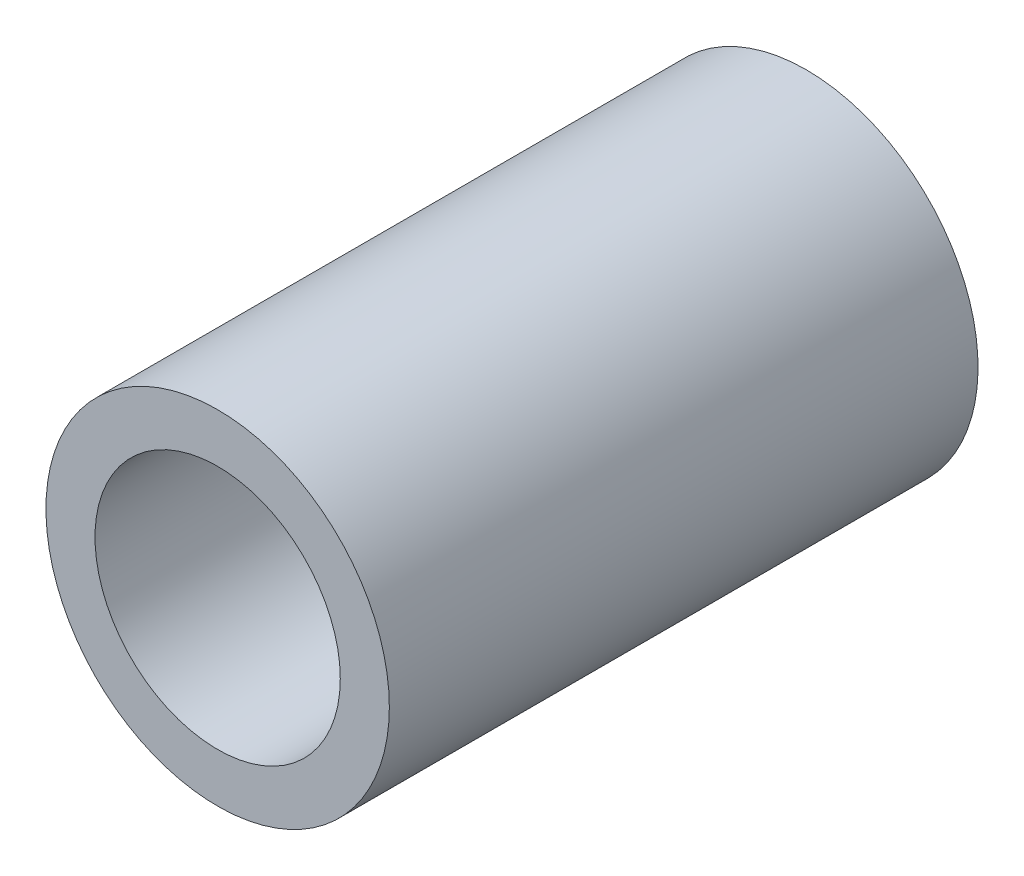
ISO-10303-21;
HEADER;
FILE_DESCRIPTION(('STEP AP214'),'2;1');
FILE_NAME('part.step','',(''),(''),'','','');
FILE_SCHEMA(('AUTOMOTIVE_DESIGN { 1 0 10303 214 1 1 1 1 }'));
ENDSEC;
DATA;
#1=APPLICATION_CONTEXT('core data for automotive mechanical design processes');
#2=APPLICATION_PROTOCOL_DEFINITION('international standard','automotive_design',2000,#1);
#3=PRODUCT_CONTEXT('',#1,'mechanical');
#4=PRODUCT('Part','Part','',(#3));
#5=PRODUCT_RELATED_PRODUCT_CATEGORY('part','',(#4));
#6=PRODUCT_DEFINITION_FORMATION('','',#4);
#7=PRODUCT_DEFINITION_CONTEXT('part definition',#1,'design');
#8=PRODUCT_DEFINITION('design','',#6,#7);
#9=PRODUCT_DEFINITION_SHAPE('','',#8);
#10=(LENGTH_UNIT() NAMED_UNIT(*) SI_UNIT(.MILLI.,.METRE.));
#11=(NAMED_UNIT(*) PLANE_ANGLE_UNIT() SI_UNIT($,.RADIAN.));
#12=(NAMED_UNIT(*) SI_UNIT($,.STERADIAN.) SOLID_ANGLE_UNIT());
#13=UNCERTAINTY_MEASURE_WITH_UNIT(LENGTH_MEASURE(1.E-05),#10,'distance_accuracy_value','');
#14=(GEOMETRIC_REPRESENTATION_CONTEXT(3) GLOBAL_UNCERTAINTY_ASSIGNED_CONTEXT((#13)) GLOBAL_UNIT_ASSIGNED_CONTEXT((#10,
#11,#12)) REPRESENTATION_CONTEXT('',''));
#15=CARTESIAN_POINT('',(0.,0.,0.));
#16=DIRECTION('',(0.,0.,1.));
#17=DIRECTION('',(1.,0.,0.));
#18=AXIS2_PLACEMENT_3D('',#15,#16,#17);
#19=CARTESIAN_POINT('',(0.,0.,65.));
#20=DIRECTION('',(0.,0.,-1.));
#21=DIRECTION('',(-1.,0.,0.));
#22=AXIS2_PLACEMENT_3D('',#19,#20,#21);
#23=CYLINDRICAL_SURFACE('',#22,17.5);
#24=CARTESIAN_POINT('',(0.,0.,65.));
#25=DIRECTION('',(0.,0.,1.));
#26=DIRECTION('',(1.,0.,0.));
#27=AXIS2_PLACEMENT_3D('',#24,#25,#26);
#28=CIRCLE('',#27,17.5);
#29=CARTESIAN_POINT('',(17.5,0.,65.));
#30=VERTEX_POINT('',#29);
#31=EDGE_CURVE('E118',#30,#30,#28,.T.);
#32=ORIENTED_EDGE('',*,*,#31,.F.);
#33=EDGE_LOOP('',(#32));
#34=FACE_BOUND('',#33,.T.);
#35=CARTESIAN_POINT('',(0.,0.,35.));
#36=DIRECTION('',(0.,0.,-1.));
#37=DIRECTION('',(-1.,0.,0.));
#38=AXIS2_PLACEMENT_3D('',#35,#36,#37);
#39=CIRCLE('',#38,17.5);
#40=CARTESIAN_POINT('',(-2.5,-17.3205080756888,35.));
#41=VERTEX_POINT('',#40);
#42=CARTESIAN_POINT('',(2.49999999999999,-17.3205080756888,35.));
#43=VERTEX_POINT('',#42);
#44=EDGE_CURVE('E106',#41,#43,#39,.F.);
#45=ORIENTED_EDGE('',*,*,#44,.T.);
#46=CARTESIAN_POINT('',(2.49999999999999,-17.3205080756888,35.));
#47=CARTESIAN_POINT('',(2.63552451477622,-17.3009488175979,35.00000101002));
#48=CARTESIAN_POINT('',(2.7707973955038,-17.2797975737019,34.9972444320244));
#49=CARTESIAN_POINT('',(3.0405860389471,-17.2343708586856,34.9862902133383));
#50=CARTESIAN_POINT('',(3.17510185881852,-17.2100956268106,34.9780929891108));
#51=CARTESIAN_POINT('',(3.57689084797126,-17.1327213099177,34.9454730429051));
#52=CARTESIAN_POINT('',(3.84268283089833,-17.0750334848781,34.9130217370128));
#53=CARTESIAN_POINT('',(4.36637452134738,-16.9486550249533,34.8278483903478));
#54=CARTESIAN_POINT('',(4.6243145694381,-16.880039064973,34.7752607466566));
#55=CARTESIAN_POINT('',(5.13252513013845,-16.7325192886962,34.6508164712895));
#56=CARTESIAN_POINT('',(5.38279434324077,-16.6536137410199,34.578956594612));
#57=CARTESIAN_POINT('',(5.87346725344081,-16.4869441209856,34.417337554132));
#58=CARTESIAN_POINT('',(6.11389903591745,-16.3992081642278,34.327634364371));
#59=CARTESIAN_POINT('',(6.58463102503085,-16.2159314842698,34.131310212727));
#60=CARTESIAN_POINT('',(6.81493157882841,-16.1203910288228,34.0246898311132));
#61=CARTESIAN_POINT('',(7.26496027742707,-15.9226526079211,33.7953989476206));
#62=CARTESIAN_POINT('',(7.48466983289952,-15.8204436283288,33.6727015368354));
#63=CARTESIAN_POINT('',(7.91247912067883,-15.6108752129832,33.4123590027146));
#64=CARTESIAN_POINT('',(8.12057754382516,-15.5035151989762,33.2747121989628));
#65=CARTESIAN_POINT('',(8.54774178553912,-15.2725764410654,32.9687828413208));
#66=CARTESIAN_POINT('',(8.76534456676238,-15.1485460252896,32.7987968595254));
#67=CARTESIAN_POINT('',(9.18494033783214,-14.8978725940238,32.4422700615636));
#68=CARTESIAN_POINT('',(9.38693168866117,-14.7712293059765,32.2557275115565));
#69=CARTESIAN_POINT('',(9.77484393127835,-14.5174435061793,31.866740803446));
#70=CARTESIAN_POINT('',(9.9607578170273,-14.3903008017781,31.6642897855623));
#71=CARTESIAN_POINT('',(10.31582005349,-14.1379376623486,31.244086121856));
#72=CARTESIAN_POINT('',(10.4849700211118,-14.0127170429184,31.0263349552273));
#73=CARTESIAN_POINT('',(10.7927724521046,-13.7768123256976,30.5941470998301));
#74=CARTESIAN_POINT('',(10.9327857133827,-13.6657728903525,30.3808736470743));
#75=CARTESIAN_POINT('',(11.1973235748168,-13.4498732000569,29.9418854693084));
#76=CARTESIAN_POINT('',(11.3218472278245,-13.3450133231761,29.7161699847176));
#77=CARTESIAN_POINT('',(11.5542769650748,-13.1442853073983,29.2528981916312));
#78=CARTESIAN_POINT('',(11.6622046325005,-13.0484055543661,29.0153578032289));
#79=CARTESIAN_POINT('',(11.8604501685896,-12.8684752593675,28.5285973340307));
#80=CARTESIAN_POINT('',(11.9507663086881,-12.7844258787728,28.2793761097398));
#81=CARTESIAN_POINT('',(12.0934930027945,-12.6492970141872,27.8296378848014));
#82=CARTESIAN_POINT('',(12.1498325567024,-12.5950982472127,27.6313000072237));
#83=CARTESIAN_POINT('',(12.2505720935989,-12.4971366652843,27.22918345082));
#84=CARTESIAN_POINT('',(12.2949793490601,-12.4533674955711,27.0254081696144));
#85=CARTESIAN_POINT('',(12.3711345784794,-12.3777183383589,26.613817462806));
#86=CARTESIAN_POINT('',(12.4029112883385,-12.3458113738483,26.4060123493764));
#87=CARTESIAN_POINT('',(12.4533700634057,-12.2949125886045,25.987330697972));
#88=CARTESIAN_POINT('',(12.4720603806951,-12.2759126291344,25.77645618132));
#89=CARTESIAN_POINT('',(12.4893506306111,-12.2583100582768,25.4709030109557));
#90=CARTESIAN_POINT('',(12.4933430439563,-12.2542400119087,25.3767952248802));
#91=CARTESIAN_POINT('',(12.4986674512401,-12.24880901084,25.1884625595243));
#92=CARTESIAN_POINT('',(12.5000004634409,-12.2474470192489,25.0942377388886));
#93=CARTESIAN_POINT('',(12.5,-12.2474487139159,25.));
#94=B_SPLINE_CURVE_WITH_KNOTS('',3,(#46,#47,#48,#49,#50,#51,#52,#53,#54,#55,#56,#57,#58,#59,#60,
#61,#62,#63,#64,#65,#66,#67,#68,#69,#70,#71,#72,#73,#74,#75,#76,#77,#78,#79,#80,#81,#82,#83,#84,
#85,#86,#87,#88,#89,#90,#91,#92,#93),.UNSPECIFIED.,.F.,.F.,(4,2,2,2,2,2,2,2,2,2,2,2,2,2,2,2,2,2,
2,2,2,2,2,4),(0.,0.410707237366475,0.821383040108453,1.64189733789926,2.45702808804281,
3.27229617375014,4.08504600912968,4.89776797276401,5.71186803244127,6.52605969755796,
7.43326698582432,8.34056939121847,9.24826519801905,10.1558733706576,10.9898789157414,
11.8239354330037,12.6568979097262,13.4899421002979,14.1289211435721,14.7675098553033,
15.4046372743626,16.0413625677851,16.3241393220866,16.6068077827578),.UNSPECIFIED.);
#95=CARTESIAN_POINT('',(12.5,-12.2474487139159,25.));
#96=VERTEX_POINT('',#95);
#97=EDGE_CURVE('E132',#43,#96,#94,.T.);
#98=ORIENTED_EDGE('',*,*,#97,.T.);
#99=DIRECTION('',(0.,0.,-1.));
#100=VECTOR('',#99,1.);
#101=CARTESIAN_POINT('',(12.5,-12.2474487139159,65.));
#102=LINE('',#101,#100);
#103=CARTESIAN_POINT('',(12.5,-12.2474487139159,5.));
#104=VERTEX_POINT('',#103);
#105=EDGE_CURVE('E115',#96,#104,#102,.T.);
#106=ORIENTED_EDGE('',*,*,#105,.T.);
#107=CARTESIAN_POINT('',(0.,0.,5.));
#108=DIRECTION('',(0.,0.,1.));
#109=DIRECTION('',(1.,0.,0.));
#110=AXIS2_PLACEMENT_3D('',#107,#108,#109);
#111=CIRCLE('',#110,17.5);
#112=CARTESIAN_POINT('',(-12.5,-12.2474487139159,5.));
#113=VERTEX_POINT('',#112);
#114=EDGE_CURVE('E100',#104,#113,#111,.T.);
#115=ORIENTED_EDGE('',*,*,#114,.T.);
#116=DIRECTION('',(0.,0.,-1.));
#117=VECTOR('',#116,1.);
#118=CARTESIAN_POINT('',(-12.5,-12.2474487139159,65.));
#119=LINE('',#118,#117);
#120=CARTESIAN_POINT('',(-12.5,-12.2474487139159,25.));
#121=VERTEX_POINT('',#120);
#122=EDGE_CURVE('E105',#113,#121,#119,.F.);
#123=ORIENTED_EDGE('',*,*,#122,.T.);
#124=CARTESIAN_POINT('',(-12.5,-12.2474487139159,25.));
#125=CARTESIAN_POINT('',(-12.5000022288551,-12.2474428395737,25.1186163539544));
#126=CARTESIAN_POINT('',(-12.497888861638,-12.2496037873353,25.2372115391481));
#127=CARTESIAN_POINT('',(-12.4894586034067,-12.2582004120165,25.4740839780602));
#128=CARTESIAN_POINT('',(-12.4831421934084,-12.2646355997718,25.5923612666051));
#129=CARTESIAN_POINT('',(-12.4579593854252,-12.2902342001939,25.945919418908));
#130=CARTESIAN_POINT('',(-12.432859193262,-12.3156910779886,26.1803549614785));
#131=CARTESIAN_POINT('',(-12.3670172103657,-12.3818013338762,26.6418606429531));
#132=CARTESIAN_POINT('',(-12.3264647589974,-12.4222706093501,26.8689851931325));
#133=CARTESIAN_POINT('',(-12.2305142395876,-12.5167506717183,27.3172508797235));
#134=CARTESIAN_POINT('',(-12.1751111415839,-12.5707660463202,27.5383899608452));
#135=CARTESIAN_POINT('',(-12.0507574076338,-12.6900196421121,27.9721436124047));
#136=CARTESIAN_POINT('',(-11.9818903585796,-12.7551883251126,28.1848014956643));
#137=CARTESIAN_POINT('',(-11.8313087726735,-12.8949880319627,28.6022109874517));
#138=CARTESIAN_POINT('',(-11.7495952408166,-12.9696183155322,28.8069632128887));
#139=CARTESIAN_POINT('',(-11.4856932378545,-13.2054681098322,29.4102645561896));
#140=CARTESIAN_POINT('',(-11.2851484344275,-13.3782435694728,29.796473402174));
#141=CARTESIAN_POINT('',(-10.9037143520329,-13.6894645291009,30.4288775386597));
#142=CARTESIAN_POINT('',(-10.7333761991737,-13.8237526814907,30.6837218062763));
#143=CARTESIAN_POINT('',(-10.3714560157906,-14.0973156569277,31.1752148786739));
#144=CARTESIAN_POINT('',(-10.1798671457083,-14.2365920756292,31.4118577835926));
#145=CARTESIAN_POINT('',(-9.77628996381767,-14.516699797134,31.8664464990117));
#146=CARTESIAN_POINT('',(-9.56428445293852,-14.6575323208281,32.0843762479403));
#147=CARTESIAN_POINT('',(-9.12076971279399,-14.9375475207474,32.500523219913));
#148=CARTESIAN_POINT('',(-8.88926269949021,-15.0767303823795,32.6987426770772));
#149=CARTESIAN_POINT('',(-8.4059248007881,-15.3514883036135,33.0755518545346));
#150=CARTESIAN_POINT('',(-8.15397490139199,-15.4870350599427,33.2540098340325));
#151=CARTESIAN_POINT('',(-7.63186831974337,-15.7508770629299,33.5883648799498));
#152=CARTESIAN_POINT('',(-7.36170995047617,-15.8791716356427,33.7442598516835));
#153=CARTESIAN_POINT('',(-6.80526928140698,-16.1254639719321,34.0311864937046));
#154=CARTESIAN_POINT('',(-6.51904118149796,-16.2434932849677,34.1622959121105));
#155=CARTESIAN_POINT('',(-5.93133374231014,-16.4671802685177,34.3981974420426));
#156=CARTESIAN_POINT('',(-5.62985965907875,-16.572842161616,34.5029985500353));
#157=CARTESIAN_POINT('',(-5.09800571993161,-16.7426293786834,34.6594442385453));
#158=CARTESIAN_POINT('',(-4.87067971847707,-16.8102203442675,34.7177900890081));
#159=CARTESIAN_POINT('',(-4.41026121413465,-16.9368407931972,34.8186769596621));
#160=CARTESIAN_POINT('',(-4.17717062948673,-16.9958730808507,34.8612231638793));
#161=CARTESIAN_POINT('',(-3.70519093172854,-17.1049828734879,34.9299868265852));
#162=CARTESIAN_POINT('',(-3.46627772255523,-17.1550115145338,34.9561169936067));
#163=CARTESIAN_POINT('',(-2.98517550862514,-17.2452610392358,34.9911455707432));
#164=CARTESIAN_POINT('',(-2.74298417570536,-17.2854745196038,35.0000310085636));
#165=CARTESIAN_POINT('',(-2.5,-17.3205080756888,35.));
#166=B_SPLINE_CURVE_WITH_KNOTS('',3,(#124,#125,#126,#127,#128,#129,#130,#131,#132,#133,#134,
#135,#136,#137,#138,#139,#140,#141,#142,#143,#144,#145,#146,#147,#148,#149,#150,#151,#152,#153,
#154,#155,#156,#157,#158,#159,#160,#161,#162,#163,#164,#165),.UNSPECIFIED.,.F.,.F.,(4,2,2,2,2,2,
2,2,2,2,2,2,2,2,2,2,2,2,2,2,4),(0.,0.355769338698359,0.711497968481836,1.42167597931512,
2.12341818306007,2.82539837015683,3.5231515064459,4.22085008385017,5.62069980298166,
6.62361429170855,7.62685251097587,8.63094338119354,9.63492030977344,10.6452316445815,
11.6556367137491,12.6628177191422,13.669653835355,14.4016881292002,15.1334820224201,
15.8691349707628,16.6053410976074),.UNSPECIFIED.);
#167=EDGE_CURVE('E52',#121,#41,#166,.T.);
#168=ORIENTED_EDGE('',*,*,#167,.T.);
#169=EDGE_LOOP('',(#45,#98,#106,#115,#123,#168));
#170=FACE_BOUND('',#169,.T.);
#171=ADVANCED_FACE('F38',(#34,#170),#23,.T.);
#172=CARTESIAN_POINT('',(0.,0.,65.));
#173=DIRECTION('',(0.,0.,1.));
#174=DIRECTION('',(1.,0.,0.));
#175=AXIS2_PLACEMENT_3D('',#172,#173,#174);
#176=PLANE('',#175);
#177=ORIENTED_EDGE('',*,*,#31,.T.);
#178=EDGE_LOOP('',(#177));
#179=FACE_BOUND('',#178,.T.);
#180=CARTESIAN_POINT('',(0.,0.,65.));
#181=DIRECTION('',(0.,0.,1.));
#182=DIRECTION('',(1.,0.,0.));
#183=AXIS2_PLACEMENT_3D('',#180,#181,#182);
#184=CIRCLE('',#183,12.5);
#185=CARTESIAN_POINT('',(12.5,0.,65.));
#186=VERTEX_POINT('',#185);
#187=EDGE_CURVE('E123',#186,#186,#184,.T.);
#188=ORIENTED_EDGE('',*,*,#187,.F.);
#189=EDGE_LOOP('',(#188));
#190=FACE_BOUND('',#189,.T.);
#191=ADVANCED_FACE('F159',(#179,#190),#176,.T.);
#192=CARTESIAN_POINT('',(0.,0.,65.));
#193=DIRECTION('',(0.,0.,-1.));
#194=DIRECTION('',(-1.,0.,0.));
#195=AXIS2_PLACEMENT_3D('',#192,#193,#194);
#196=CYLINDRICAL_SURFACE('',#195,12.5);
#197=DIRECTION('',(0.,0.,-1.));
#198=VECTOR('',#197,1.);
#199=CARTESIAN_POINT('',(12.5,0.,65.));
#200=LINE('',#199,#198);
#201=CARTESIAN_POINT('',(12.5,0.,5.));
#202=VERTEX_POINT('',#201);
#203=CARTESIAN_POINT('',(12.5,0.,25.));
#204=VERTEX_POINT('',#203);
#205=EDGE_CURVE('E175',#202,#204,#200,.F.);
#206=ORIENTED_EDGE('',*,*,#205,.T.);
#207=CARTESIAN_POINT('',(2.49999999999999,-12.2474487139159,35.));
#208=CARTESIAN_POINT('',(2.62836492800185,-12.2212486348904,35.0000016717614));
#209=CARTESIAN_POINT('',(2.75629370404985,-12.1930302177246,34.9975278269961));
#210=CARTESIAN_POINT('',(3.0110128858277,-12.1326388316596,34.9877477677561));
#211=CARTESIAN_POINT('',(3.13780342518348,-12.1004663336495,34.9804421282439));
#212=CARTESIAN_POINT('',(3.51575777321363,-11.9982272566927,34.9514818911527));
#213=CARTESIAN_POINT('',(3.76486868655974,-11.9223645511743,34.9227832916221));
#214=CARTESIAN_POINT('',(4.25318493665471,-11.7569686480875,34.8481892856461));
#215=CARTESIAN_POINT('',(4.49246020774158,-11.6675673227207,34.8024541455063));
#216=CARTESIAN_POINT('',(4.96210938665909,-11.4757062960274,34.6951562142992));
#217=CARTESIAN_POINT('',(5.19248088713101,-11.3732430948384,34.6335891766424));
#218=CARTESIAN_POINT('',(5.64207505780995,-11.1570120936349,34.4964384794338));
#219=CARTESIAN_POINT('',(5.86134509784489,-11.0432997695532,34.420922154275));
#220=CARTESIAN_POINT('',(6.28909331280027,-10.8054266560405,34.2571727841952));
#221=CARTESIAN_POINT('',(6.49757236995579,-10.6812667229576,34.1689407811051));
#222=CARTESIAN_POINT('',(7.10716904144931,-10.2941716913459,33.8867706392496));
#223=CARTESIAN_POINT('',(7.4915684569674,-10.0170503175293,33.6756355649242));
#224=CARTESIAN_POINT('',(8.1293774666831,-9.50210905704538,33.271497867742));
#225=CARTESIAN_POINT('',(8.39242141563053,-9.27020937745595,33.0857620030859));
#226=CARTESIAN_POINT('',(8.89184672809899,-8.79229528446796,32.6970373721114));
#227=CARTESIAN_POINT('',(9.12821673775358,-8.54627492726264,32.49404132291));
#228=CARTESIAN_POINT('',(9.57516746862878,-8.04237841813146,32.0736373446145));
#229=CARTESIAN_POINT('',(9.78569988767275,-7.78448126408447,31.856203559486));
#230=CARTESIAN_POINT('',(10.1813179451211,-7.25939452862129,31.4098575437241));
#231=CARTESIAN_POINT('',(10.3664042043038,-6.99220517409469,31.1809455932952));
#232=CARTESIAN_POINT('',(10.7762372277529,-6.34957093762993,30.6269671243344));
#233=CARTESIAN_POINT('',(10.9901814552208,-5.97077737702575,30.2977659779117));
#234=CARTESIAN_POINT('',(11.3740002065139,-5.20255599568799,29.6262047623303));
#235=CARTESIAN_POINT('',(11.5438547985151,-4.81312345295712,29.2838388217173));
#236=CARTESIAN_POINT('',(11.8410301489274,-4.02696456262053,28.5899154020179));
#237=CARTESIAN_POINT('',(11.9683837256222,-3.63024409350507,28.2383652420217));
#238=CARTESIAN_POINT('',(12.1820224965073,-2.83178959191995,27.5289514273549));
#239=CARTESIAN_POINT('',(12.2683259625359,-2.43005787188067,27.1710906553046));
#240=CARTESIAN_POINT('',(12.3894375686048,-1.69300549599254,26.5135128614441));
#241=CARTESIAN_POINT('',(12.4305540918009,-1.35816144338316,26.214395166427));
#242=CARTESIAN_POINT('',(12.4855910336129,-0.687739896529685,25.6151303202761));
#243=CARTESIAN_POINT('',(12.4995416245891,-0.352163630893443,25.3149846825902));
#244=CARTESIAN_POINT('',(12.4999962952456,-0.011111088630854,25.0099380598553));
#245=CARTESIAN_POINT('',(12.4999999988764,-0.00555553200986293,25.0049690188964));
#246=CARTESIAN_POINT('',(12.5,0.,25.));
#247=B_SPLINE_CURVE_WITH_KNOTS('',3,(#207,#208,#209,#210,#211,#212,#213,#214,#215,#216,#217,
#218,#219,#220,#221,#222,#223,#224,#225,#226,#227,#228,#229,#230,#231,#232,#233,#234,#235,#236,
#237,#238,#239,#240,#241,#242,#243,#244,#245,#246),.UNSPECIFIED.,.F.,.F.,(4,2,2,2,2,2,2,2,2,2,2,
2,2,2,2,2,2,2,2,4),(0.,0.392950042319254,0.785853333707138,1.57054881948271,2.34804163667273,
3.12574321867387,3.89978447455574,4.67376234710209,6.22473551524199,7.41376610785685,
8.60330092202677,9.79502669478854,10.9867233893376,12.6210409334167,14.2560960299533,
15.8898856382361,17.5229473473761,18.8747935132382,20.2251373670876,20.2474980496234),.UNSPECIFIED.);
#248=CARTESIAN_POINT('',(2.49999999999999,-12.2474487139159,35.));
#249=VERTEX_POINT('',#248);
#250=EDGE_CURVE('E139',#204,#249,#247,.F.);
#251=ORIENTED_EDGE('',*,*,#250,.T.);
#252=CARTESIAN_POINT('',(0.,0.,35.));
#253=DIRECTION('',(0.,0.,-1.));
#254=DIRECTION('',(-1.,0.,0.));
#255=AXIS2_PLACEMENT_3D('',#252,#253,#254);
#256=CIRCLE('',#255,12.5);
#257=CARTESIAN_POINT('',(-2.5,-12.2474487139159,35.));
#258=VERTEX_POINT('',#257);
#259=EDGE_CURVE('E178',#258,#249,#256,.F.);
#260=ORIENTED_EDGE('',*,*,#259,.F.);
#261=CARTESIAN_POINT('',(-2.5,-12.2474487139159,35.));
#262=CARTESIAN_POINT('',(-2.62836492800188,-12.2212486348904,35.0000016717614));
#263=CARTESIAN_POINT('',(-2.75629370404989,-12.1930302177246,34.9975278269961));
#264=CARTESIAN_POINT('',(-3.01101288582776,-12.1326388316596,34.9877477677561));
#265=CARTESIAN_POINT('',(-3.13780342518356,-12.1004663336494,34.9804421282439));
#266=CARTESIAN_POINT('',(-3.51575777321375,-11.9982272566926,34.9514818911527));
#267=CARTESIAN_POINT('',(-3.76486868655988,-11.9223645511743,34.9227832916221));
#268=CARTESIAN_POINT('',(-4.25318493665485,-11.7569686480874,34.8481892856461));
#269=CARTESIAN_POINT('',(-4.49246020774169,-11.6675673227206,34.8024541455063));
#270=CARTESIAN_POINT('',(-4.96210938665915,-11.4757062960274,34.6951562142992));
#271=CARTESIAN_POINT('',(-5.19248088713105,-11.3732430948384,34.6335891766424));
#272=CARTESIAN_POINT('',(-5.64207505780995,-11.1570120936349,34.4964384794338));
#273=CARTESIAN_POINT('',(-5.86134509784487,-11.0432997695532,34.420922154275));
#274=CARTESIAN_POINT('',(-6.28909331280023,-10.8054266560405,34.2571727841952));
#275=CARTESIAN_POINT('',(-6.49757236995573,-10.6812667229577,34.1689407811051));
#276=CARTESIAN_POINT('',(-7.10716904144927,-10.2941716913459,33.8867706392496));
#277=CARTESIAN_POINT('',(-7.49156845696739,-10.0170503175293,33.6756355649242));
#278=CARTESIAN_POINT('',(-8.12937746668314,-9.50210905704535,33.2714978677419));
#279=CARTESIAN_POINT('',(-8.3924214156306,-9.2702093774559,33.0857620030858));
#280=CARTESIAN_POINT('',(-8.8918467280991,-8.79229528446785,32.6970373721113));
#281=CARTESIAN_POINT('',(-9.12821673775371,-8.5462749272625,32.4940413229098));
#282=CARTESIAN_POINT('',(-9.57516746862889,-8.04237841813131,32.0736373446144));
#283=CARTESIAN_POINT('',(-9.78569988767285,-7.78448126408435,31.8562035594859));
#284=CARTESIAN_POINT('',(-10.1813179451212,-7.25939452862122,31.4098575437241));
#285=CARTESIAN_POINT('',(-10.3664042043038,-6.99220517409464,31.1809455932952));
#286=CARTESIAN_POINT('',(-10.7762372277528,-6.34957093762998,30.6269671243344));
#287=CARTESIAN_POINT('',(-10.9901814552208,-5.9707773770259,30.2977659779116));
#288=CARTESIAN_POINT('',(-11.3740002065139,-5.20255599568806,29.6262047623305));
#289=CARTESIAN_POINT('',(-11.543854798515,-4.81312345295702,29.2838388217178));
#290=CARTESIAN_POINT('',(-11.8410301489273,-4.026964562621,28.5899154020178));
#291=CARTESIAN_POINT('',(-11.9683837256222,-3.6302440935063,28.2383652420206));
#292=CARTESIAN_POINT('',(-12.1820224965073,-2.8317895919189,27.5289514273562));
#293=CARTESIAN_POINT('',(-12.2683259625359,-2.43005787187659,27.1710906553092));
#294=CARTESIAN_POINT('',(-12.3894375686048,-1.6930054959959,26.5135128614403));
#295=CARTESIAN_POINT('',(-12.4305540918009,-1.35816144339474,26.214395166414));
#296=CARTESIAN_POINT('',(-12.4855910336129,-0.687739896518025,25.6151303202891));
#297=CARTESIAN_POINT('',(-12.4995416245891,-0.352163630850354,25.3149846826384));
#298=CARTESIAN_POINT('',(-12.4999962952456,-0.011111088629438,25.0099380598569));
#299=CARTESIAN_POINT('',(-12.4999999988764,-0.00555553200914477,25.0049690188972));
#300=CARTESIAN_POINT('',(-12.5,0.,25.));
#301=B_SPLINE_CURVE_WITH_KNOTS('',3,(#261,#262,#263,#264,#265,#266,#267,#268,#269,#270,#271,
#272,#273,#274,#275,#276,#277,#278,#279,#280,#281,#282,#283,#284,#285,#286,#287,#288,#289,#290,
#291,#292,#293,#294,#295,#296,#297,#298,#299,#300),.UNSPECIFIED.,.F.,.F.,(4,2,2,2,2,2,2,2,2,2,2,
2,2,2,2,2,2,2,2,4),(0.,0.392950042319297,0.785853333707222,1.57054881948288,2.34804163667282,
3.12574321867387,3.89978447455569,4.67376234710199,6.224735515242,7.41376610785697,
8.60330092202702,9.79502669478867,10.9867233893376,12.6210409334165,14.256096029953,
15.889885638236,17.5229473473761,18.8747935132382,20.2251373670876,20.2474980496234),.UNSPECIFIED.);
#302=CARTESIAN_POINT('',(-12.5,0.,25.));
#303=VERTEX_POINT('',#302);
#304=EDGE_CURVE('E11',#258,#303,#301,.T.);
#305=ORIENTED_EDGE('',*,*,#304,.T.);
#306=DIRECTION('',(0.,0.,-1.));
#307=VECTOR('',#306,1.);
#308=CARTESIAN_POINT('',(-12.5,0.,65.));
#309=LINE('',#308,#307);
#310=CARTESIAN_POINT('',(-12.5,0.,5.));
#311=VERTEX_POINT('',#310);
#312=EDGE_CURVE('E182',#311,#303,#309,.F.);
#313=ORIENTED_EDGE('',*,*,#312,.F.);
#314=CARTESIAN_POINT('',(0.,0.,5.));
#315=DIRECTION('',(0.,0.,1.));
#316=DIRECTION('',(1.,0.,0.));
#317=AXIS2_PLACEMENT_3D('',#314,#315,#316);
#318=CIRCLE('',#317,12.5);
#319=EDGE_CURVE('E103',#202,#311,#318,.T.);
#320=ORIENTED_EDGE('',*,*,#319,.F.);
#321=EDGE_LOOP('',(#206,#251,#260,#305,#313,#320));
#322=FACE_BOUND('',#321,.T.);
#323=ORIENTED_EDGE('',*,*,#187,.T.);
#324=EDGE_LOOP('',(#323));
#325=FACE_BOUND('',#324,.T.);
#326=ADVANCED_FACE('F166',(#322,#325),#196,.F.);
#327=CARTESIAN_POINT('',(12.5,100.001,5.));
#328=DIRECTION('',(-1.,0.,0.));
#329=DIRECTION('',(0.,0.,1.));
#330=AXIS2_PLACEMENT_3D('',#327,#328,#329);
#331=PLANE('',#330);
#332=ORIENTED_EDGE('',*,*,#105,.F.);
#333=DIRECTION('',(0.,-1.,0.));
#334=VECTOR('',#333,1.);
#335=CARTESIAN_POINT('',(12.5,0.,25.));
#336=LINE('',#335,#334);
#337=EDGE_CURVE('E129',#96,#204,#336,.F.);
#338=ORIENTED_EDGE('',*,*,#337,.T.);
#339=ORIENTED_EDGE('',*,*,#205,.F.);
#340=DIRECTION('',(0.,-1.,0.));
#341=VECTOR('',#340,1.);
#342=CARTESIAN_POINT('',(12.5,100.001,5.));
#343=LINE('',#342,#341);
#344=EDGE_CURVE('E181',#202,#104,#343,.T.);
#345=ORIENTED_EDGE('',*,*,#344,.T.);
#346=EDGE_LOOP('',(#332,#338,#339,#345));
#347=FACE_BOUND('',#346,.T.);
#348=ADVANCED_FACE('F188',(#347),#331,.T.);
#349=CARTESIAN_POINT('',(-12.5,100.001,35.));
#350=DIRECTION('',(0.,0.,-1.));
#351=DIRECTION('',(-1.,0.,0.));
#352=AXIS2_PLACEMENT_3D('',#349,#350,#351);
#353=PLANE('',#352);
#354=ORIENTED_EDGE('',*,*,#259,.T.);
#355=DIRECTION('',(0.,-1.,0.));
#356=VECTOR('',#355,1.);
#357=CARTESIAN_POINT('',(2.49999999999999,-12.2474487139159,35.));
#358=LINE('',#357,#356);
#359=EDGE_CURVE('E120',#249,#43,#358,.T.);
#360=ORIENTED_EDGE('',*,*,#359,.T.);
#361=ORIENTED_EDGE('',*,*,#44,.F.);
#362=DIRECTION('',(0.,-1.,0.));
#363=VECTOR('',#362,1.);
#364=CARTESIAN_POINT('',(-2.5,0.,35.));
#365=LINE('',#364,#363);
#366=EDGE_CURVE('E117',#41,#258,#365,.F.);
#367=ORIENTED_EDGE('',*,*,#366,.T.);
#368=EDGE_LOOP('',(#354,#360,#361,#367));
#369=FACE_BOUND('',#368,.T.);
#370=ADVANCED_FACE('F155',(#369),#353,.T.);
#371=CARTESIAN_POINT('',(-12.5,100.001,5.));
#372=DIRECTION('',(1.,0.,0.));
#373=DIRECTION('',(0.,0.,-1.));
#374=AXIS2_PLACEMENT_3D('',#371,#372,#373);
#375=PLANE('',#374);
#376=ORIENTED_EDGE('',*,*,#312,.T.);
#377=DIRECTION('',(0.,-1.,0.));
#378=VECTOR('',#377,1.);
#379=CARTESIAN_POINT('',(-12.5,-12.2474487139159,25.));
#380=LINE('',#379,#378);
#381=EDGE_CURVE('E110',#303,#121,#380,.T.);
#382=ORIENTED_EDGE('',*,*,#381,.T.);
#383=ORIENTED_EDGE('',*,*,#122,.F.);
#384=DIRECTION('',(0.,-1.,0.));
#385=VECTOR('',#384,1.);
#386=CARTESIAN_POINT('',(-12.5,100.001,5.));
#387=LINE('',#386,#385);
#388=EDGE_CURVE('E96',#311,#113,#387,.T.);
#389=ORIENTED_EDGE('',*,*,#388,.F.);
#390=EDGE_LOOP('',(#376,#382,#383,#389));
#391=FACE_BOUND('',#390,.T.);
#392=ADVANCED_FACE('F109',(#391),#375,.T.);
#393=CARTESIAN_POINT('',(2.5,100.001,25.));
#394=DIRECTION('',(0.,1.,0.));
#395=DIRECTION('',(0.,0.,1.));
#396=AXIS2_PLACEMENT_3D('',#393,#394,#395);
#397=CYLINDRICAL_SURFACE('',#396,10.);
#398=ORIENTED_EDGE('',*,*,#250,.F.);
#399=ORIENTED_EDGE('',*,*,#337,.F.);
#400=ORIENTED_EDGE('',*,*,#97,.F.);
#401=ORIENTED_EDGE('',*,*,#359,.F.);
#402=EDGE_LOOP('',(#398,#399,#400,#401));
#403=FACE_BOUND('',#402,.T.);
#404=ADVANCED_FACE('F146',(#403),#397,.F.);
#405=CARTESIAN_POINT('',(-2.5,100.001,25.));
#406=DIRECTION('',(0.,1.,0.));
#407=DIRECTION('',(0.,0.,1.));
#408=AXIS2_PLACEMENT_3D('',#405,#406,#407);
#409=CYLINDRICAL_SURFACE('',#408,10.);
#410=ORIENTED_EDGE('',*,*,#304,.F.);
#411=ORIENTED_EDGE('',*,*,#366,.F.);
#412=ORIENTED_EDGE('',*,*,#167,.F.);
#413=ORIENTED_EDGE('',*,*,#381,.F.);
#414=EDGE_LOOP('',(#410,#411,#412,#413));
#415=FACE_BOUND('',#414,.T.);
#416=ADVANCED_FACE('F40',(#415),#409,.F.);
#417=CARTESIAN_POINT('',(-100.,-130.,5.));
#418=DIRECTION('',(0.,0.,1.));
#419=DIRECTION('',(1.,0.,0.));
#420=AXIS2_PLACEMENT_3D('',#417,#418,#419);
#421=PLANE('',#420);
#422=ORIENTED_EDGE('',*,*,#344,.F.);
#423=ORIENTED_EDGE('',*,*,#319,.T.);
#424=ORIENTED_EDGE('',*,*,#388,.T.);
#425=ORIENTED_EDGE('',*,*,#114,.F.);
#426=EDGE_LOOP('',(#422,#423,#424,#425));
#427=FACE_BOUND('',#426,.T.);
#428=ADVANCED_FACE('F98',(#427),#421,.F.);
#429=CLOSED_SHELL('',(#171,#191,#326,#348,#370,#392,#404,#416,#428));
#430=MANIFOLD_SOLID_BREP('B2',#429);
#431=ADVANCED_BREP_SHAPE_REPRESENTATION('',(#18,#430),#14);
#432=SHAPE_DEFINITION_REPRESENTATION(#9,#431);
ENDSEC;
END-ISO-10303-21;
